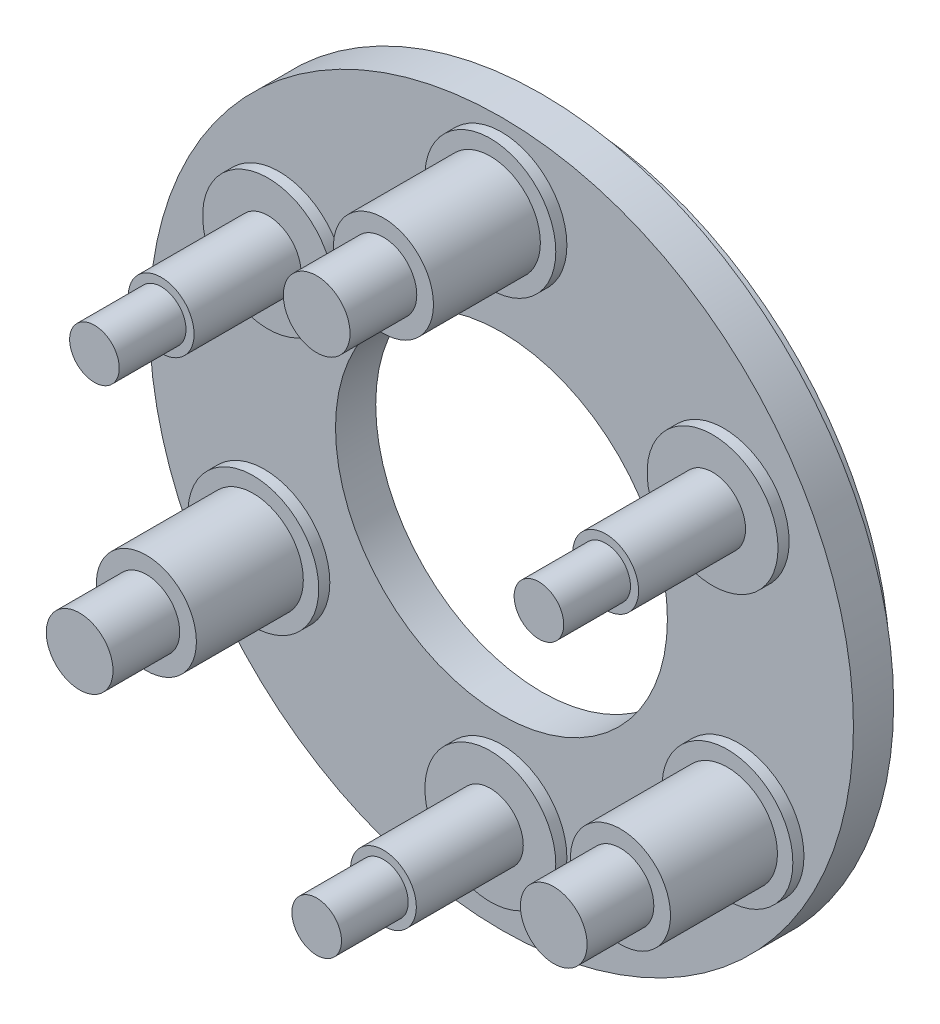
from build123d import *

# Parameters (mm, degrees)
SKETCH1_R         = 10.4521
SKETCH1_R_2       = 4.9276
BASE_DEPTH        = 1.1938
SKETCH2_R         = 9.6393
SKETCH2_R_2       = 8.89
TRACK_DEPTH       = 0.7112
SKETCH3_R         = 1.9431
PLATFORM_1_DEPTH  = 0.3302
SKETCH4_R         = 1.4859
SKETCH4_R_2       = 0.9779
PLATFORM_2_DEPTH  = 3.175
SKETCH5_R         = 0.9906
SKETCH5_R_2       = 0.7366
PLATFORM_3_DEPTH  = 1.9812
CIRPATTERN1_COUNT = 3


with BuildPart() as part:
    # Sketch1 → Base (new body)
    with BuildSketch(Plane.XY):
        Circle(SKETCH1_R)
        Circle(SKETCH1_R_2, mode=Mode.SUBTRACT)
    extrude(amount=BASE_DEPTH)

    # Sketch2 → Track (add)
    with BuildSketch(Plane(origin=(0, 0, 0), x_dir=(-1, 0, 0), z_dir=(0, 0, -1))):
        with Locations(Location((0, 0, 0), (0, 0, 180))):
            Circle(SKETCH2_R)
        Circle(SKETCH2_R_2, mode=Mode.SUBTRACT)
    extrude(amount=TRACK_DEPTH)

    # Sketch3 → Platform 1 (add)
    with BuildSketch(Plane.XY.offset(1.1938)):
        with Locations((0, 8.128)):
            Circle(SKETCH3_R)
        with Locations((0, -7.62)):
            Circle(SKETCH3_R)
    platform_1 = extrude(amount=PLATFORM_1_DEPTH)

    # Sketch4 → Platform 2 (add)
    with BuildSketch(Plane.XY.offset(1.524)):
        with Locations((0, 8.128)):
            Circle(SKETCH4_R)
        with Locations((0, -7.62)):
            Circle(SKETCH4_R_2)
    platform_2 = extrude(amount=PLATFORM_2_DEPTH)

    # Sketch5 → Platform 3 (add)
    with BuildSketch(Plane.XY.offset(4.699)):
        with Locations((0, 8.128)):
            Circle(SKETCH5_R)
        with Locations((0, -7.62)):
            Circle(SKETCH5_R_2)
    platform_3 = extrude(amount=PLATFORM_3_DEPTH)

    # CirPattern1: Platform 1, Platform 2, Platform 3 ×3 about axis
    cirpattern1_axis = Axis((0, 0, 0), (0, 0, 1))
    add([platform_1.rotate(cirpattern1_axis, i * 360 / CIRPATTERN1_COUNT) for i in range(1, CIRPATTERN1_COUNT)])
    add([platform_2.rotate(cirpattern1_axis, i * 360 / CIRPATTERN1_COUNT) for i in range(1, CIRPATTERN1_COUNT)])
    add([platform_3.rotate(cirpattern1_axis, i * 360 / CIRPATTERN1_COUNT) for i in range(1, CIRPATTERN1_COUNT)])


solid = part.part
